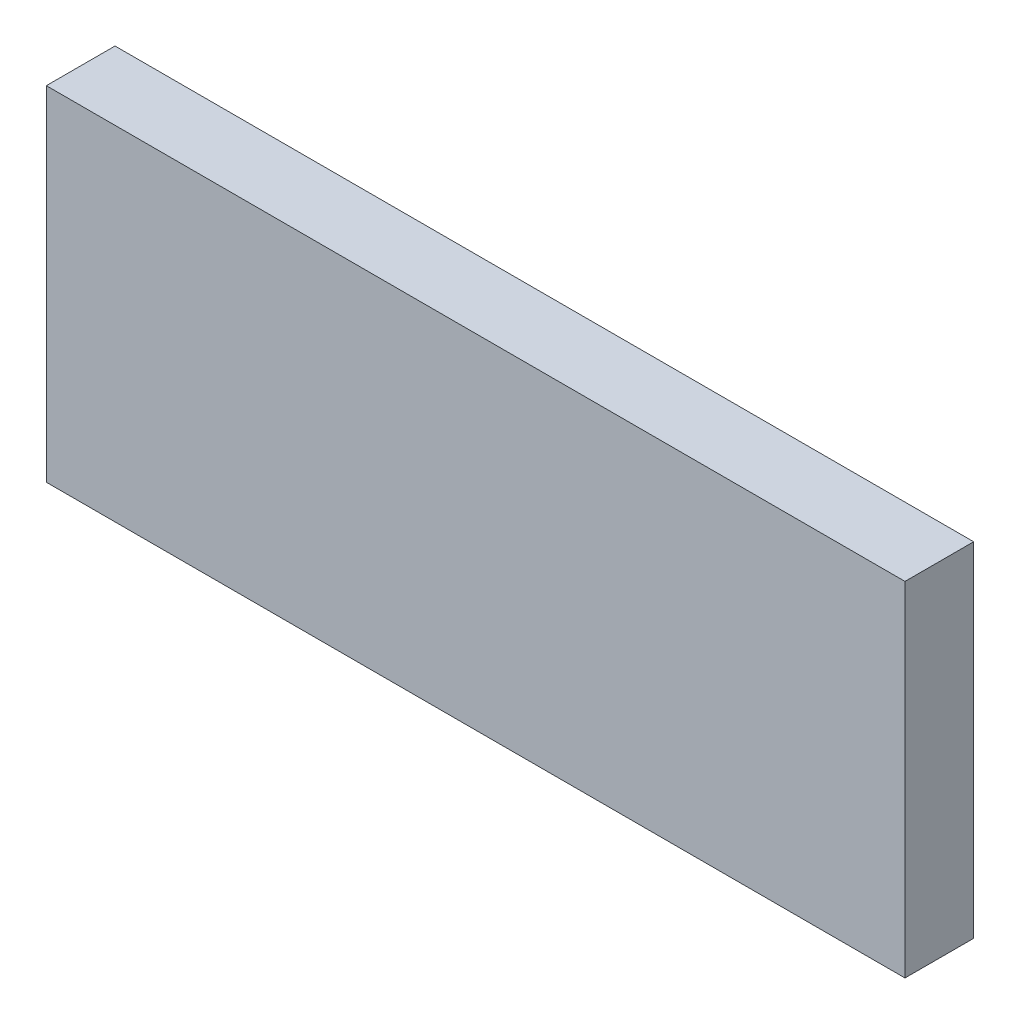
ISO-10303-21;
HEADER;
FILE_DESCRIPTION(('STEP AP214'),'2;1');
FILE_NAME('part.step','',(''),(''),'','','');
FILE_SCHEMA(('AUTOMOTIVE_DESIGN { 1 0 10303 214 1 1 1 1 }'));
ENDSEC;
DATA;
#1=APPLICATION_CONTEXT('core data for automotive mechanical design processes');
#2=APPLICATION_PROTOCOL_DEFINITION('international standard','automotive_design',2000,#1);
#3=PRODUCT_CONTEXT('',#1,'mechanical');
#4=PRODUCT('Part','Part','',(#3));
#5=PRODUCT_RELATED_PRODUCT_CATEGORY('part','',(#4));
#6=PRODUCT_DEFINITION_FORMATION('','',#4);
#7=PRODUCT_DEFINITION_CONTEXT('part definition',#1,'design');
#8=PRODUCT_DEFINITION('design','',#6,#7);
#9=PRODUCT_DEFINITION_SHAPE('','',#8);
#10=(LENGTH_UNIT() NAMED_UNIT(*) SI_UNIT(.MILLI.,.METRE.));
#11=(NAMED_UNIT(*) PLANE_ANGLE_UNIT() SI_UNIT($,.RADIAN.));
#12=(NAMED_UNIT(*) SI_UNIT($,.STERADIAN.) SOLID_ANGLE_UNIT());
#13=UNCERTAINTY_MEASURE_WITH_UNIT(LENGTH_MEASURE(1.E-05),#10,'distance_accuracy_value','');
#14=(GEOMETRIC_REPRESENTATION_CONTEXT(3) GLOBAL_UNCERTAINTY_ASSIGNED_CONTEXT((#13)) GLOBAL_UNIT_ASSIGNED_CONTEXT((#10,
#11,#12)) REPRESENTATION_CONTEXT('',''));
#15=CARTESIAN_POINT('',(0.,0.,0.));
#16=DIRECTION('',(0.,0.,1.));
#17=DIRECTION('',(1.,0.,0.));
#18=AXIS2_PLACEMENT_3D('',#15,#16,#17);
#19=CARTESIAN_POINT('',(0.,0.,8.));
#20=DIRECTION('',(1.,0.,0.));
#21=DIRECTION('',(0.,0.,-1.));
#22=AXIS2_PLACEMENT_3D('',#19,#20,#21);
#23=PLANE('',#22);
#24=DIRECTION('',(0.,-1.,0.));
#25=VECTOR('',#24,1.);
#26=CARTESIAN_POINT('',(0.,0.,0.));
#27=LINE('',#26,#25);
#28=CARTESIAN_POINT('',(0.,40.,0.));
#29=VERTEX_POINT('',#28);
#30=CARTESIAN_POINT('',(0.,0.,0.));
#31=VERTEX_POINT('',#30);
#32=EDGE_CURVE('E102',#29,#31,#27,.T.);
#33=ORIENTED_EDGE('',*,*,#32,.T.);
#34=DIRECTION('',(0.,0.,-1.));
#35=VECTOR('',#34,1.);
#36=CARTESIAN_POINT('',(0.,0.,8.));
#37=LINE('',#36,#35);
#38=CARTESIAN_POINT('',(0.,0.,8.));
#39=VERTEX_POINT('',#38);
#40=EDGE_CURVE('E11',#39,#31,#37,.T.);
#41=ORIENTED_EDGE('',*,*,#40,.F.);
#42=DIRECTION('',(0.,-1.,0.));
#43=VECTOR('',#42,1.);
#44=CARTESIAN_POINT('',(0.,0.,8.));
#45=LINE('',#44,#43);
#46=CARTESIAN_POINT('',(0.,40.,8.));
#47=VERTEX_POINT('',#46);
#48=EDGE_CURVE('E90',#47,#39,#45,.T.);
#49=ORIENTED_EDGE('',*,*,#48,.F.);
#50=DIRECTION('',(0.,0.,-1.));
#51=VECTOR('',#50,1.);
#52=CARTESIAN_POINT('',(0.,40.,8.));
#53=LINE('',#52,#51);
#54=EDGE_CURVE('E98',#47,#29,#53,.T.);
#55=ORIENTED_EDGE('',*,*,#54,.T.);
#56=EDGE_LOOP('',(#33,#41,#49,#55));
#57=FACE_BOUND('',#56,.T.);
#58=ADVANCED_FACE('F39',(#57),#23,.F.);
#59=CARTESIAN_POINT('',(0.,0.,8.));
#60=DIRECTION('',(0.,1.,0.));
#61=DIRECTION('',(0.,0.,1.));
#62=AXIS2_PLACEMENT_3D('',#59,#60,#61);
#63=PLANE('',#62);
#64=DIRECTION('',(1.,0.,0.));
#65=VECTOR('',#64,1.);
#66=CARTESIAN_POINT('',(0.,0.,0.));
#67=LINE('',#66,#65);
#68=CARTESIAN_POINT('',(100.,0.,0.));
#69=VERTEX_POINT('',#68);
#70=EDGE_CURVE('E94',#31,#69,#67,.T.);
#71=ORIENTED_EDGE('',*,*,#70,.T.);
#72=DIRECTION('',(0.,0.,-1.));
#73=VECTOR('',#72,1.);
#74=CARTESIAN_POINT('',(100.,0.,8.));
#75=LINE('',#74,#73);
#76=CARTESIAN_POINT('',(100.,0.,8.));
#77=VERTEX_POINT('',#76);
#78=EDGE_CURVE('E47',#77,#69,#75,.T.);
#79=ORIENTED_EDGE('',*,*,#78,.F.);
#80=DIRECTION('',(1.,0.,0.));
#81=VECTOR('',#80,1.);
#82=CARTESIAN_POINT('',(0.,0.,8.));
#83=LINE('',#82,#81);
#84=EDGE_CURVE('E85',#39,#77,#83,.T.);
#85=ORIENTED_EDGE('',*,*,#84,.F.);
#86=ORIENTED_EDGE('',*,*,#40,.T.);
#87=EDGE_LOOP('',(#71,#79,#85,#86));
#88=FACE_BOUND('',#87,.T.);
#89=ADVANCED_FACE('F93',(#88),#63,.F.);
#90=CARTESIAN_POINT('',(100.,0.,8.));
#91=DIRECTION('',(-1.,0.,0.));
#92=DIRECTION('',(0.,0.,1.));
#93=AXIS2_PLACEMENT_3D('',#90,#91,#92);
#94=PLANE('',#93);
#95=DIRECTION('',(0.,1.,0.));
#96=VECTOR('',#95,1.);
#97=CARTESIAN_POINT('',(100.,0.,0.));
#98=LINE('',#97,#96);
#99=CARTESIAN_POINT('',(100.,40.,0.));
#100=VERTEX_POINT('',#99);
#101=EDGE_CURVE('E72',#69,#100,#98,.T.);
#102=ORIENTED_EDGE('',*,*,#101,.T.);
#103=DIRECTION('',(0.,0.,-1.));
#104=VECTOR('',#103,1.);
#105=CARTESIAN_POINT('',(100.,40.,8.));
#106=LINE('',#105,#104);
#107=CARTESIAN_POINT('',(100.,40.,8.));
#108=VERTEX_POINT('',#107);
#109=EDGE_CURVE('E95',#108,#100,#106,.T.);
#110=ORIENTED_EDGE('',*,*,#109,.F.);
#111=DIRECTION('',(0.,1.,0.));
#112=VECTOR('',#111,1.);
#113=CARTESIAN_POINT('',(100.,0.,8.));
#114=LINE('',#113,#112);
#115=EDGE_CURVE('E88',#77,#108,#114,.T.);
#116=ORIENTED_EDGE('',*,*,#115,.F.);
#117=ORIENTED_EDGE('',*,*,#78,.T.);
#118=EDGE_LOOP('',(#102,#110,#116,#117));
#119=FACE_BOUND('',#118,.T.);
#120=ADVANCED_FACE('F96',(#119),#94,.F.);
#121=CARTESIAN_POINT('',(0.,40.,8.));
#122=DIRECTION('',(0.,-1.,0.));
#123=DIRECTION('',(0.,0.,-1.));
#124=AXIS2_PLACEMENT_3D('',#121,#122,#123);
#125=PLANE('',#124);
#126=DIRECTION('',(-1.,0.,0.));
#127=VECTOR('',#126,1.);
#128=CARTESIAN_POINT('',(0.,40.,0.));
#129=LINE('',#128,#127);
#130=EDGE_CURVE('E78',#100,#29,#129,.T.);
#131=ORIENTED_EDGE('',*,*,#130,.T.);
#132=ORIENTED_EDGE('',*,*,#54,.F.);
#133=DIRECTION('',(-1.,0.,0.));
#134=VECTOR('',#133,1.);
#135=CARTESIAN_POINT('',(0.,40.,8.));
#136=LINE('',#135,#134);
#137=EDGE_CURVE('E55',#108,#47,#136,.T.);
#138=ORIENTED_EDGE('',*,*,#137,.F.);
#139=ORIENTED_EDGE('',*,*,#109,.T.);
#140=EDGE_LOOP('',(#131,#132,#138,#139));
#141=FACE_BOUND('',#140,.T.);
#142=ADVANCED_FACE('F109',(#141),#125,.F.);
#143=CARTESIAN_POINT('',(0.,40.,8.));
#144=DIRECTION('',(0.,0.,-1.));
#145=DIRECTION('',(-1.,0.,0.));
#146=AXIS2_PLACEMENT_3D('',#143,#144,#145);
#147=PLANE('',#146);
#148=ORIENTED_EDGE('',*,*,#48,.T.);
#149=ORIENTED_EDGE('',*,*,#84,.T.);
#150=ORIENTED_EDGE('',*,*,#115,.T.);
#151=ORIENTED_EDGE('',*,*,#137,.T.);
#152=EDGE_LOOP('',(#148,#149,#150,#151));
#153=FACE_BOUND('',#152,.T.);
#154=ADVANCED_FACE('F86',(#153),#147,.F.);
#155=CARTESIAN_POINT('',(0.,40.,0.));
#156=DIRECTION('',(0.,0.,-1.));
#157=DIRECTION('',(-1.,0.,0.));
#158=AXIS2_PLACEMENT_3D('',#155,#156,#157);
#159=PLANE('',#158);
#160=ORIENTED_EDGE('',*,*,#32,.F.);
#161=ORIENTED_EDGE('',*,*,#130,.F.);
#162=ORIENTED_EDGE('',*,*,#101,.F.);
#163=ORIENTED_EDGE('',*,*,#70,.F.);
#164=EDGE_LOOP('',(#160,#161,#162,#163));
#165=FACE_BOUND('',#164,.T.);
#166=ADVANCED_FACE('F112',(#165),#159,.T.);
#167=CLOSED_SHELL('',(#58,#89,#120,#142,#154,#166));
#168=MANIFOLD_SOLID_BREP('B2',#167);
#169=ADVANCED_BREP_SHAPE_REPRESENTATION('',(#18,#168),#14);
#170=SHAPE_DEFINITION_REPRESENTATION(#9,#169);
ENDSEC;
END-ISO-10303-21;
